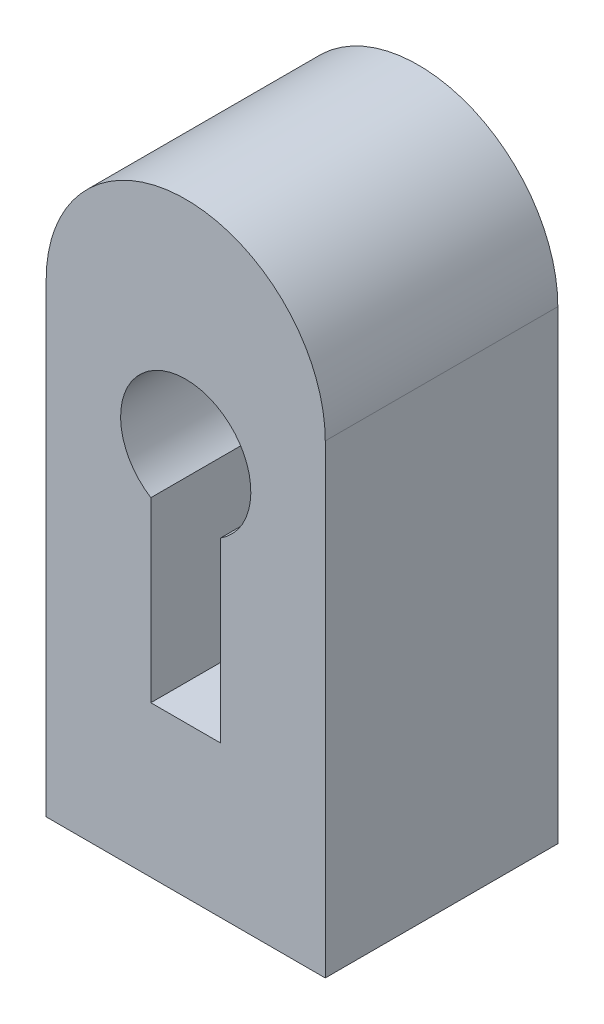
ISO-10303-21;
HEADER;
FILE_DESCRIPTION(('STEP AP214'),'2;1');
FILE_NAME('part.step','',(''),(''),'','','');
FILE_SCHEMA(('AUTOMOTIVE_DESIGN { 1 0 10303 214 1 1 1 1 }'));
ENDSEC;
DATA;
#1=APPLICATION_CONTEXT('core data for automotive mechanical design processes');
#2=APPLICATION_PROTOCOL_DEFINITION('international standard','automotive_design',2000,#1);
#3=PRODUCT_CONTEXT('',#1,'mechanical');
#4=PRODUCT('Part','Part','',(#3));
#5=PRODUCT_RELATED_PRODUCT_CATEGORY('part','',(#4));
#6=PRODUCT_DEFINITION_FORMATION('','',#4);
#7=PRODUCT_DEFINITION_CONTEXT('part definition',#1,'design');
#8=PRODUCT_DEFINITION('design','',#6,#7);
#9=PRODUCT_DEFINITION_SHAPE('','',#8);
#10=(LENGTH_UNIT() NAMED_UNIT(*) SI_UNIT(.MILLI.,.METRE.));
#11=(NAMED_UNIT(*) PLANE_ANGLE_UNIT() SI_UNIT($,.RADIAN.));
#12=(NAMED_UNIT(*) SI_UNIT($,.STERADIAN.) SOLID_ANGLE_UNIT());
#13=UNCERTAINTY_MEASURE_WITH_UNIT(LENGTH_MEASURE(1.E-05),#10,'distance_accuracy_value','');
#14=(GEOMETRIC_REPRESENTATION_CONTEXT(3) GLOBAL_UNCERTAINTY_ASSIGNED_CONTEXT((#13)) GLOBAL_UNIT_ASSIGNED_CONTEXT((#10,
#11,#12)) REPRESENTATION_CONTEXT('',''));
#15=CARTESIAN_POINT('',(0.,0.,0.));
#16=DIRECTION('',(0.,0.,1.));
#17=DIRECTION('',(1.,0.,0.));
#18=AXIS2_PLACEMENT_3D('',#15,#16,#17);
#19=CARTESIAN_POINT('',(0.,127.,63.5));
#20=DIRECTION('',(0.,0.,-1.));
#21=DIRECTION('',(-1.,0.,0.));
#22=AXIS2_PLACEMENT_3D('',#19,#20,#21);
#23=CYLINDRICAL_SURFACE('',#22,76.2);
#24=CARTESIAN_POINT('',(0.,127.,-63.5));
#25=DIRECTION('',(0.,0.,1.));
#26=DIRECTION('',(-1.,0.,0.));
#27=AXIS2_PLACEMENT_3D('',#24,#25,#26);
#28=CIRCLE('',#27,76.2);
#29=CARTESIAN_POINT('',(76.2,127.,-63.5));
#30=VERTEX_POINT('',#29);
#31=CARTESIAN_POINT('',(-76.2,127.,-63.5));
#32=VERTEX_POINT('',#31);
#33=EDGE_CURVE('E127',#30,#32,#28,.T.);
#34=ORIENTED_EDGE('',*,*,#33,.T.);
#35=DIRECTION('',(0.,0.,-1.));
#36=VECTOR('',#35,1.);
#37=CARTESIAN_POINT('',(-76.2,127.,63.5));
#38=LINE('',#37,#36);
#39=CARTESIAN_POINT('',(-76.2,127.,63.5));
#40=VERTEX_POINT('',#39);
#41=EDGE_CURVE('E11',#40,#32,#38,.T.);
#42=ORIENTED_EDGE('',*,*,#41,.F.);
#43=CARTESIAN_POINT('',(0.,127.,63.5));
#44=DIRECTION('',(0.,0.,1.));
#45=DIRECTION('',(-1.,0.,0.));
#46=AXIS2_PLACEMENT_3D('',#43,#44,#45);
#47=CIRCLE('',#46,76.2);
#48=CARTESIAN_POINT('',(76.2,127.,63.5));
#49=VERTEX_POINT('',#48);
#50=EDGE_CURVE('E138',#49,#40,#47,.T.);
#51=ORIENTED_EDGE('',*,*,#50,.F.);
#52=DIRECTION('',(0.,0.,-1.));
#53=VECTOR('',#52,1.);
#54=CARTESIAN_POINT('',(76.2,127.,63.5));
#55=LINE('',#54,#53);
#56=EDGE_CURVE('E147',#49,#30,#55,.T.);
#57=ORIENTED_EDGE('',*,*,#56,.T.);
#58=EDGE_LOOP('',(#34,#42,#51,#57));
#59=FACE_BOUND('',#58,.T.);
#60=ADVANCED_FACE('F29',(#59),#23,.T.);
#61=CARTESIAN_POINT('',(-76.2,127.,63.5));
#62=DIRECTION('',(1.,0.,0.));
#63=DIRECTION('',(0.,1.,0.));
#64=AXIS2_PLACEMENT_3D('',#61,#62,#63);
#65=PLANE('',#64);
#66=DIRECTION('',(0.,-1.,0.));
#67=VECTOR('',#66,1.);
#68=CARTESIAN_POINT('',(-76.2,127.,-63.5));
#69=LINE('',#68,#67);
#70=CARTESIAN_POINT('',(-76.2,-127.,-63.5));
#71=VERTEX_POINT('',#70);
#72=EDGE_CURVE('E132',#32,#71,#69,.T.);
#73=ORIENTED_EDGE('',*,*,#72,.T.);
#74=DIRECTION('',(0.,0.,-1.));
#75=VECTOR('',#74,1.);
#76=CARTESIAN_POINT('',(-76.2,-127.,63.5));
#77=LINE('',#76,#75);
#78=CARTESIAN_POINT('',(-76.2,-127.,63.5));
#79=VERTEX_POINT('',#78);
#80=EDGE_CURVE('E36',#79,#71,#77,.T.);
#81=ORIENTED_EDGE('',*,*,#80,.F.);
#82=DIRECTION('',(0.,-1.,0.));
#83=VECTOR('',#82,1.);
#84=CARTESIAN_POINT('',(-76.2,127.,63.5));
#85=LINE('',#84,#83);
#86=EDGE_CURVE('E141',#40,#79,#85,.T.);
#87=ORIENTED_EDGE('',*,*,#86,.F.);
#88=ORIENTED_EDGE('',*,*,#41,.T.);
#89=EDGE_LOOP('',(#73,#81,#87,#88));
#90=FACE_BOUND('',#89,.T.);
#91=ADVANCED_FACE('F171',(#90),#65,.F.);
#92=CARTESIAN_POINT('',(-76.2,-127.,63.5));
#93=DIRECTION('',(0.,1.,0.));
#94=DIRECTION('',(0.,0.,1.));
#95=AXIS2_PLACEMENT_3D('',#92,#93,#94);
#96=PLANE('',#95);
#97=DIRECTION('',(1.,0.,0.));
#98=VECTOR('',#97,1.);
#99=CARTESIAN_POINT('',(-76.2,-127.,-63.5));
#100=LINE('',#99,#98);
#101=CARTESIAN_POINT('',(76.2,-127.,-63.5));
#102=VERTEX_POINT('',#101);
#103=EDGE_CURVE('E134',#71,#102,#100,.T.);
#104=ORIENTED_EDGE('',*,*,#103,.T.);
#105=DIRECTION('',(0.,0.,-1.));
#106=VECTOR('',#105,1.);
#107=CARTESIAN_POINT('',(76.2,-127.,63.5));
#108=LINE('',#107,#106);
#109=CARTESIAN_POINT('',(76.2,-127.,63.5));
#110=VERTEX_POINT('',#109);
#111=EDGE_CURVE('E150',#110,#102,#108,.T.);
#112=ORIENTED_EDGE('',*,*,#111,.F.);
#113=DIRECTION('',(1.,0.,0.));
#114=VECTOR('',#113,1.);
#115=CARTESIAN_POINT('',(-76.2,-127.,63.5));
#116=LINE('',#115,#114);
#117=EDGE_CURVE('E143',#79,#110,#116,.T.);
#118=ORIENTED_EDGE('',*,*,#117,.F.);
#119=ORIENTED_EDGE('',*,*,#80,.T.);
#120=EDGE_LOOP('',(#104,#112,#118,#119));
#121=FACE_BOUND('',#120,.T.);
#122=ADVANCED_FACE('F157',(#121),#96,.F.);
#123=CARTESIAN_POINT('',(76.2,127.,63.5));
#124=DIRECTION('',(-1.,0.,0.));
#125=DIRECTION('',(0.,-1.,0.));
#126=AXIS2_PLACEMENT_3D('',#123,#124,#125);
#127=PLANE('',#126);
#128=DIRECTION('',(0.,1.,0.));
#129=VECTOR('',#128,1.);
#130=CARTESIAN_POINT('',(76.2,127.,-63.5));
#131=LINE('',#130,#129);
#132=EDGE_CURVE('E136',#102,#30,#131,.T.);
#133=ORIENTED_EDGE('',*,*,#132,.T.);
#134=ORIENTED_EDGE('',*,*,#56,.F.);
#135=DIRECTION('',(0.,1.,0.));
#136=VECTOR('',#135,1.);
#137=CARTESIAN_POINT('',(76.2,127.,63.5));
#138=LINE('',#137,#136);
#139=EDGE_CURVE('E145',#110,#49,#138,.T.);
#140=ORIENTED_EDGE('',*,*,#139,.F.);
#141=ORIENTED_EDGE('',*,*,#111,.T.);
#142=EDGE_LOOP('',(#133,#134,#140,#141));
#143=FACE_BOUND('',#142,.T.);
#144=ADVANCED_FACE('F166',(#143),#127,.F.);
#145=CARTESIAN_POINT('',(0.,127.,63.5));
#146=DIRECTION('',(0.,0.,-1.));
#147=DIRECTION('',(-1.,0.,0.));
#148=AXIS2_PLACEMENT_3D('',#145,#146,#147);
#149=PLANE('',#148);
#150=DIRECTION('',(0.,-1.,0.));
#151=VECTOR('',#150,1.);
#152=CARTESIAN_POINT('',(-19.05,52.5231603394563,63.5));
#153=LINE('',#152,#151);
#154=CARTESIAN_POINT('',(-19.05,52.5231603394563,63.5));
#155=VERTEX_POINT('',#154);
#156=CARTESIAN_POINT('',(-19.05,-44.45,63.5));
#157=VERTEX_POINT('',#156);
#158=EDGE_CURVE('E104',#155,#157,#153,.T.);
#159=ORIENTED_EDGE('',*,*,#158,.F.);
#160=CARTESIAN_POINT('',(0.,82.55,63.5));
#161=DIRECTION('',(0.,0.,1.));
#162=DIRECTION('',(1.,0.,0.));
#163=AXIS2_PLACEMENT_3D('',#160,#161,#162);
#164=CIRCLE('',#163,35.56);
#165=CARTESIAN_POINT('',(19.05,52.5231603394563,63.5));
#166=VERTEX_POINT('',#165);
#167=EDGE_CURVE('E43',#166,#155,#164,.T.);
#168=ORIENTED_EDGE('',*,*,#167,.F.);
#169=DIRECTION('',(0.,1.,0.));
#170=VECTOR('',#169,1.);
#171=CARTESIAN_POINT('',(19.05,52.5231603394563,63.5));
#172=LINE('',#171,#170);
#173=CARTESIAN_POINT('',(19.05,-44.45,63.5));
#174=VERTEX_POINT('',#173);
#175=EDGE_CURVE('E111',#174,#166,#172,.T.);
#176=ORIENTED_EDGE('',*,*,#175,.F.);
#177=DIRECTION('',(1.,0.,0.));
#178=VECTOR('',#177,1.);
#179=CARTESIAN_POINT('',(19.05,-44.45,63.5));
#180=LINE('',#179,#178);
#181=EDGE_CURVE('E95',#157,#174,#180,.T.);
#182=ORIENTED_EDGE('',*,*,#181,.F.);
#183=EDGE_LOOP('',(#159,#168,#176,#182));
#184=FACE_BOUND('',#183,.T.);
#185=ORIENTED_EDGE('',*,*,#50,.T.);
#186=ORIENTED_EDGE('',*,*,#86,.T.);
#187=ORIENTED_EDGE('',*,*,#117,.T.);
#188=ORIENTED_EDGE('',*,*,#139,.T.);
#189=EDGE_LOOP('',(#185,#186,#187,#188));
#190=FACE_BOUND('',#189,.T.);
#191=ADVANCED_FACE('F108',(#184,#190),#149,.F.);
#192=CARTESIAN_POINT('',(0.,127.,-63.5));
#193=DIRECTION('',(0.,0.,-1.));
#194=DIRECTION('',(-1.,0.,0.));
#195=AXIS2_PLACEMENT_3D('',#192,#193,#194);
#196=PLANE('',#195);
#197=CARTESIAN_POINT('',(0.,82.55,-63.5));
#198=DIRECTION('',(0.,0.,1.));
#199=DIRECTION('',(1.,0.,0.));
#200=AXIS2_PLACEMENT_3D('',#197,#198,#199);
#201=CIRCLE('',#200,35.56);
#202=CARTESIAN_POINT('',(19.05,52.5231603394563,-63.5));
#203=VERTEX_POINT('',#202);
#204=CARTESIAN_POINT('',(-19.05,52.5231603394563,-63.5));
#205=VERTEX_POINT('',#204);
#206=EDGE_CURVE('E113',#203,#205,#201,.T.);
#207=ORIENTED_EDGE('',*,*,#206,.T.);
#208=DIRECTION('',(0.,-1.,0.));
#209=VECTOR('',#208,1.);
#210=CARTESIAN_POINT('',(-19.05,52.5231603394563,-63.5));
#211=LINE('',#210,#209);
#212=CARTESIAN_POINT('',(-19.05,-44.45,-63.5));
#213=VERTEX_POINT('',#212);
#214=EDGE_CURVE('E119',#205,#213,#211,.T.);
#215=ORIENTED_EDGE('',*,*,#214,.T.);
#216=DIRECTION('',(1.,0.,0.));
#217=VECTOR('',#216,1.);
#218=CARTESIAN_POINT('',(19.05,-44.45,-63.5));
#219=LINE('',#218,#217);
#220=CARTESIAN_POINT('',(19.05,-44.45,-63.5));
#221=VERTEX_POINT('',#220);
#222=EDGE_CURVE('E51',#213,#221,#219,.T.);
#223=ORIENTED_EDGE('',*,*,#222,.T.);
#224=DIRECTION('',(0.,1.,0.));
#225=VECTOR('',#224,1.);
#226=CARTESIAN_POINT('',(19.05,52.5231603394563,-63.5));
#227=LINE('',#226,#225);
#228=EDGE_CURVE('E122',#221,#203,#227,.T.);
#229=ORIENTED_EDGE('',*,*,#228,.T.);
#230=EDGE_LOOP('',(#207,#215,#223,#229));
#231=FACE_BOUND('',#230,.T.);
#232=ORIENTED_EDGE('',*,*,#33,.F.);
#233=ORIENTED_EDGE('',*,*,#132,.F.);
#234=ORIENTED_EDGE('',*,*,#103,.F.);
#235=ORIENTED_EDGE('',*,*,#72,.F.);
#236=EDGE_LOOP('',(#232,#233,#234,#235));
#237=FACE_BOUND('',#236,.T.);
#238=ADVANCED_FACE('F163',(#231,#237),#196,.T.);
#239=CARTESIAN_POINT('',(0.,82.55,-63.5));
#240=DIRECTION('',(0.,0.,1.));
#241=DIRECTION('',(1.,0.,0.));
#242=AXIS2_PLACEMENT_3D('',#239,#240,#241);
#243=CYLINDRICAL_SURFACE('',#242,35.56);
#244=ORIENTED_EDGE('',*,*,#167,.T.);
#245=DIRECTION('',(0.,0.,1.));
#246=VECTOR('',#245,1.);
#247=CARTESIAN_POINT('',(-19.05,52.5231603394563,-63.5));
#248=LINE('',#247,#246);
#249=EDGE_CURVE('E101',#205,#155,#248,.T.);
#250=ORIENTED_EDGE('',*,*,#249,.F.);
#251=ORIENTED_EDGE('',*,*,#206,.F.);
#252=DIRECTION('',(0.,0.,1.));
#253=VECTOR('',#252,1.);
#254=CARTESIAN_POINT('',(19.05,52.5231603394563,-63.5));
#255=LINE('',#254,#253);
#256=EDGE_CURVE('E125',#203,#166,#255,.T.);
#257=ORIENTED_EDGE('',*,*,#256,.T.);
#258=EDGE_LOOP('',(#244,#250,#251,#257));
#259=FACE_BOUND('',#258,.T.);
#260=ADVANCED_FACE('F185',(#259),#243,.F.);
#261=CARTESIAN_POINT('',(19.05,52.5231603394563,-63.5));
#262=DIRECTION('',(1.,0.,0.));
#263=DIRECTION('',(0.,1.,0.));
#264=AXIS2_PLACEMENT_3D('',#261,#262,#263);
#265=PLANE('',#264);
#266=ORIENTED_EDGE('',*,*,#175,.T.);
#267=ORIENTED_EDGE('',*,*,#256,.F.);
#268=ORIENTED_EDGE('',*,*,#228,.F.);
#269=DIRECTION('',(0.,0.,1.));
#270=VECTOR('',#269,1.);
#271=CARTESIAN_POINT('',(19.05,-44.45,-63.5));
#272=LINE('',#271,#270);
#273=EDGE_CURVE('E100',#221,#174,#272,.T.);
#274=ORIENTED_EDGE('',*,*,#273,.T.);
#275=EDGE_LOOP('',(#266,#267,#268,#274));
#276=FACE_BOUND('',#275,.T.);
#277=ADVANCED_FACE('F189',(#276),#265,.F.);
#278=CARTESIAN_POINT('',(19.05,-44.45,-63.5));
#279=DIRECTION('',(0.,-1.,0.));
#280=DIRECTION('',(1.,0.,0.));
#281=AXIS2_PLACEMENT_3D('',#278,#279,#280);
#282=PLANE('',#281);
#283=ORIENTED_EDGE('',*,*,#181,.T.);
#284=ORIENTED_EDGE('',*,*,#273,.F.);
#285=ORIENTED_EDGE('',*,*,#222,.F.);
#286=DIRECTION('',(0.,0.,1.));
#287=VECTOR('',#286,1.);
#288=CARTESIAN_POINT('',(-19.05,-44.45,-63.5));
#289=LINE('',#288,#287);
#290=EDGE_CURVE('E91',#213,#157,#289,.T.);
#291=ORIENTED_EDGE('',*,*,#290,.T.);
#292=EDGE_LOOP('',(#283,#284,#285,#291));
#293=FACE_BOUND('',#292,.T.);
#294=ADVANCED_FACE('F93',(#293),#282,.F.);
#295=CARTESIAN_POINT('',(-19.05,52.5231603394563,-63.5));
#296=DIRECTION('',(-1.,0.,0.));
#297=DIRECTION('',(0.,-1.,0.));
#298=AXIS2_PLACEMENT_3D('',#295,#296,#297);
#299=PLANE('',#298);
#300=ORIENTED_EDGE('',*,*,#158,.T.);
#301=ORIENTED_EDGE('',*,*,#290,.F.);
#302=ORIENTED_EDGE('',*,*,#214,.F.);
#303=ORIENTED_EDGE('',*,*,#249,.T.);
#304=EDGE_LOOP('',(#300,#301,#302,#303));
#305=FACE_BOUND('',#304,.T.);
#306=ADVANCED_FACE('F105',(#305),#299,.F.);
#307=CLOSED_SHELL('',(#60,#91,#122,#144,#191,#238,#260,#277,#294,#306));
#308=MANIFOLD_SOLID_BREP('B2',#307);
#309=ADVANCED_BREP_SHAPE_REPRESENTATION('',(#18,#308),#14);
#310=SHAPE_DEFINITION_REPRESENTATION(#9,#309);
ENDSEC;
END-ISO-10303-21;
